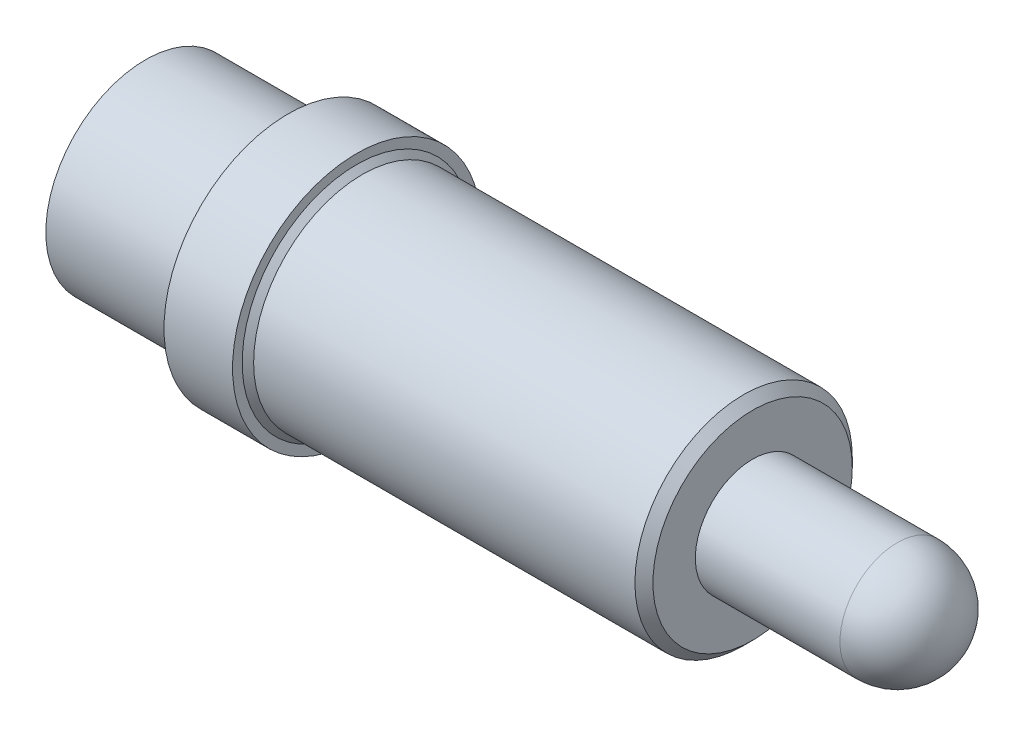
from build123d import *

# Parameters (mm, degrees)
CHAMFER1_SIZE = 0.0635
CHAMFER2_SIZE = 0.1


with BuildPart() as part:
    # Sketch1 → Revolve1 (revolve)
    with BuildSketch(Plane.XY, mode=Mode.PRIVATE) as revolve1_sk:
        with BuildLine():
            Line((0, 0), (0, 1.105))
            Line((0, 1.105), (1.58, 1.105))
            Line((1.58, 1.105), (1.58, 1.375))
            Line((1.58, 1.375), (2.34, 1.375))
            Line((2.34, 1.375), (2.34, 1.205))
            Line((2.34, 1.205), (6.73, 1.205))
            Line((6.73, 1.205), (6.73, 0.635))
            Line((6.73, 0.635), (8.333000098, 0.635))
            ThreePointArc((8.333000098, 0.635), (8.782012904, 0.449012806), (8.968000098, 0))
            Line((8.968000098, 0), (0, 0))
        make_face()
    revolve(revolve1_sk.sketch.rotate(Axis((0, 0, 0), (-1, 0, 0)), 90), axis=Axis((0, 0, 0), (-1, 0, 0)))

    # Chamfer1
    chamfer1_edges = [part.edges().sort_by_distance(p)[0] for p in [
        (2.34, 0, 1.205),
    ]]
    chamfer(chamfer1_edges, length=CHAMFER1_SIZE)

    # Chamfer2
    chamfer2_edges = [part.edges().sort_by_distance(p)[0] for p in [
        (6.73, 0, 1.205),
    ]]
    chamfer(chamfer2_edges, length=CHAMFER2_SIZE)


solid = part.part
